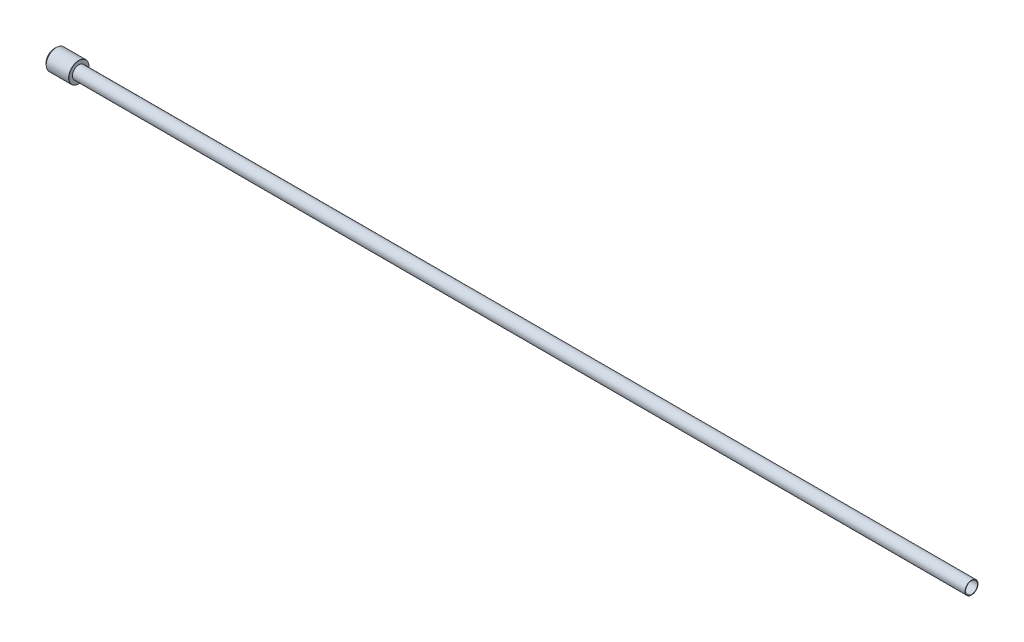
from build123d import *

# Parameters (mm, degrees)
FILLET2_R = 0.1


with BuildPart() as part:
    # Sketch1 → Revolve1 (revolve)
    with BuildSketch(Plane.XY, mode=Mode.PRIVATE) as revolve1_sk:
        Polygon((0.945, 5), (10, 5), (12, 5), (12, 3.175), (450, 3.175), (450, 2.921), (0, 2.921), (0, 4.155), (0.1, 4.155), align=None)
    revolve(revolve1_sk.sketch.rotate(Axis((-22.212185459, 0, 0), (1, 0, 0)), 90), axis=Axis((-22.212185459, 0, 0), (1, 0, 0)))

    # Fillet2
    fillet2_edges = [part.edges().sort_by_distance(p)[0] for p in [
        (12, 0, -5),
    ]]
    fillet(fillet2_edges, radius=FILLET2_R)


solid = part.part
